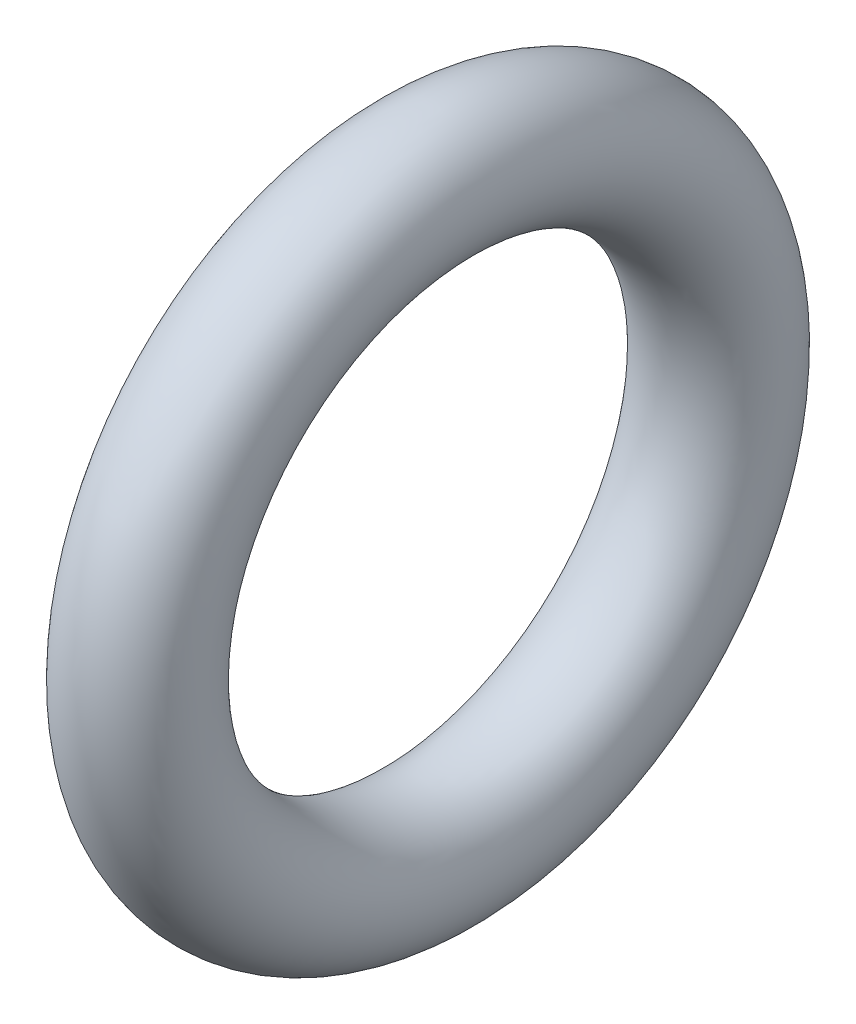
from build123d import *

# Parameters (mm, degrees)
SKETCH1_RX = 1.3081
SKETCH1_RY = 1.3081


with BuildPart() as part:
    # Sketch1 → Revolve1 (revolve)
    with BuildSketch(Plane.XY):
        with Locations((0, 5.9055)):
            Ellipse(SKETCH1_RX, SKETCH1_RY)
    revolve(axis=Axis((-14.954242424, 0, 0), (1, 0, 0)))


solid = part.part
